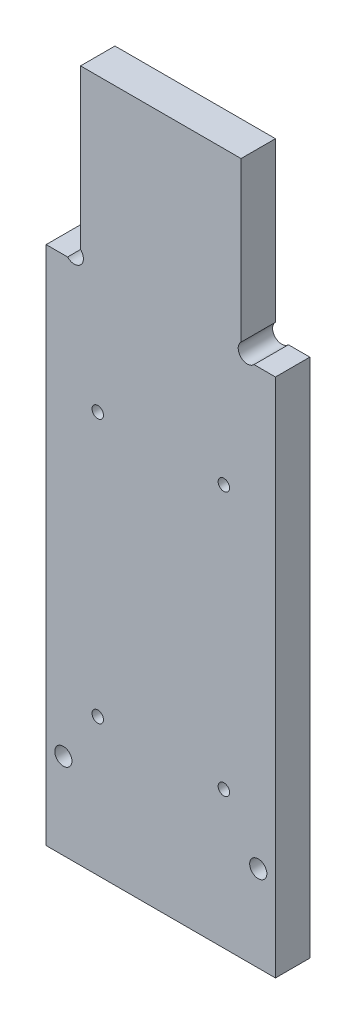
ISO-10303-21;
HEADER;
FILE_DESCRIPTION(('STEP AP214'),'2;1');
FILE_NAME('part.step','',(''),(''),'','','');
FILE_SCHEMA(('AUTOMOTIVE_DESIGN { 1 0 10303 214 1 1 1 1 }'));
ENDSEC;
DATA;
#1=APPLICATION_CONTEXT('core data for automotive mechanical design processes');
#2=APPLICATION_PROTOCOL_DEFINITION('international standard','automotive_design',2000,#1);
#3=PRODUCT_CONTEXT('',#1,'mechanical');
#4=PRODUCT('Part','Part','',(#3));
#5=PRODUCT_RELATED_PRODUCT_CATEGORY('part','',(#4));
#6=PRODUCT_DEFINITION_FORMATION('','',#4);
#7=PRODUCT_DEFINITION_CONTEXT('part definition',#1,'design');
#8=PRODUCT_DEFINITION('design','',#6,#7);
#9=PRODUCT_DEFINITION_SHAPE('','',#8);
#10=(LENGTH_UNIT() NAMED_UNIT(*) SI_UNIT(.MILLI.,.METRE.));
#11=(NAMED_UNIT(*) PLANE_ANGLE_UNIT() SI_UNIT($,.RADIAN.));
#12=(NAMED_UNIT(*) SI_UNIT($,.STERADIAN.) SOLID_ANGLE_UNIT());
#13=UNCERTAINTY_MEASURE_WITH_UNIT(LENGTH_MEASURE(1.E-05),#10,'distance_accuracy_value','');
#14=(GEOMETRIC_REPRESENTATION_CONTEXT(3) GLOBAL_UNCERTAINTY_ASSIGNED_CONTEXT((#13)) GLOBAL_UNIT_ASSIGNED_CONTEXT((#10,
#11,#12)) REPRESENTATION_CONTEXT('',''));
#15=CARTESIAN_POINT('',(0.,0.,0.));
#16=DIRECTION('',(0.,0.,1.));
#17=DIRECTION('',(1.,0.,0.));
#18=AXIS2_PLACEMENT_3D('',#15,#16,#17);
#19=CARTESIAN_POINT('',(-60.9183606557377,49.4675409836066,6.));
#20=DIRECTION('',(1.,0.,0.));
#21=DIRECTION('',(0.,1.,0.));
#22=AXIS2_PLACEMENT_3D('',#19,#20,#21);
#23=PLANE('',#22);
#24=DIRECTION('',(0.,-1.,0.));
#25=VECTOR('',#24,1.);
#26=CARTESIAN_POINT('',(-60.9183606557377,49.4675409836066,6.));
#27=LINE('',#26,#25);
#28=CARTESIAN_POINT('',(-60.9183606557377,19.4675409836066,6.));
#29=VERTEX_POINT('',#28);
#30=CARTESIAN_POINT('',(-60.9183606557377,-71.3324590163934,6.));
#31=VERTEX_POINT('',#30);
#32=EDGE_CURVE('E167',#29,#31,#27,.T.);
#33=ORIENTED_EDGE('',*,*,#32,.F.);
#34=DIRECTION('',(0.,0.,1.));
#35=VECTOR('',#34,1.);
#36=CARTESIAN_POINT('',(-60.9183606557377,19.4675409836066,0.));
#37=LINE('',#36,#35);
#38=CARTESIAN_POINT('',(-60.9183606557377,19.4675409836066,0.));
#39=VERTEX_POINT('',#38);
#40=EDGE_CURVE('E152',#39,#29,#37,.T.);
#41=ORIENTED_EDGE('',*,*,#40,.F.);
#42=DIRECTION('',(0.,-1.,0.));
#43=VECTOR('',#42,1.);
#44=CARTESIAN_POINT('',(-60.9183606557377,49.4675409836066,0.));
#45=LINE('',#44,#43);
#46=CARTESIAN_POINT('',(-60.9183606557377,-71.3324590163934,0.));
#47=VERTEX_POINT('',#46);
#48=EDGE_CURVE('E156',#39,#47,#45,.T.);
#49=ORIENTED_EDGE('',*,*,#48,.T.);
#50=DIRECTION('',(0.,0.,-1.));
#51=VECTOR('',#50,1.);
#52=CARTESIAN_POINT('',(-60.9183606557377,-71.3324590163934,6.));
#53=LINE('',#52,#51);
#54=EDGE_CURVE('E178',#31,#47,#53,.T.);
#55=ORIENTED_EDGE('',*,*,#54,.F.);
#56=EDGE_LOOP('',(#33,#41,#49,#55));
#57=FACE_BOUND('',#56,.T.);
#58=ADVANCED_FACE('F32',(#57),#23,.F.);
#59=CARTESIAN_POINT('',(-60.9183606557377,-71.3324590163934,6.));
#60=DIRECTION('',(0.,1.,0.));
#61=DIRECTION('',(0.,0.,1.));
#62=AXIS2_PLACEMENT_3D('',#59,#60,#61);
#63=PLANE('',#62);
#64=DIRECTION('',(1.,0.,0.));
#65=VECTOR('',#64,1.);
#66=CARTESIAN_POINT('',(-60.9183606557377,-71.3324590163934,0.));
#67=LINE('',#66,#65);
#68=CARTESIAN_POINT('',(-20.9183606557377,-71.3324590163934,0.));
#69=VERTEX_POINT('',#68);
#70=EDGE_CURVE('E159',#47,#69,#67,.T.);
#71=ORIENTED_EDGE('',*,*,#70,.T.);
#72=DIRECTION('',(0.,0.,-1.));
#73=VECTOR('',#72,1.);
#74=CARTESIAN_POINT('',(-20.9183606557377,-71.3324590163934,6.));
#75=LINE('',#74,#73);
#76=CARTESIAN_POINT('',(-20.9183606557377,-71.3324590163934,6.));
#77=VERTEX_POINT('',#76);
#78=EDGE_CURVE('E175',#77,#69,#75,.T.);
#79=ORIENTED_EDGE('',*,*,#78,.F.);
#80=DIRECTION('',(1.,0.,0.));
#81=VECTOR('',#80,1.);
#82=CARTESIAN_POINT('',(-60.9183606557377,-71.3324590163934,6.));
#83=LINE('',#82,#81);
#84=EDGE_CURVE('E169',#31,#77,#83,.T.);
#85=ORIENTED_EDGE('',*,*,#84,.F.);
#86=ORIENTED_EDGE('',*,*,#54,.T.);
#87=EDGE_LOOP('',(#71,#79,#85,#86));
#88=FACE_BOUND('',#87,.T.);
#89=ADVANCED_FACE('F233',(#88),#63,.F.);
#90=CARTESIAN_POINT('',(-20.9183606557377,49.4675409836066,6.));
#91=DIRECTION('',(-1.,0.,0.));
#92=DIRECTION('',(0.,-1.,0.));
#93=AXIS2_PLACEMENT_3D('',#90,#91,#92);
#94=PLANE('',#93);
#95=DIRECTION('',(0.,1.,0.));
#96=VECTOR('',#95,1.);
#97=CARTESIAN_POINT('',(-20.9183606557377,49.4675409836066,0.));
#98=LINE('',#97,#96);
#99=CARTESIAN_POINT('',(-20.9183606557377,19.4675409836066,0.));
#100=VERTEX_POINT('',#99);
#101=EDGE_CURVE('E161',#69,#100,#98,.T.);
#102=ORIENTED_EDGE('',*,*,#101,.T.);
#103=DIRECTION('',(0.,0.,1.));
#104=VECTOR('',#103,1.);
#105=CARTESIAN_POINT('',(-20.9183606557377,19.4675409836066,0.));
#106=LINE('',#105,#104);
#107=CARTESIAN_POINT('',(-20.9183606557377,19.4675409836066,6.));
#108=VERTEX_POINT('',#107);
#109=EDGE_CURVE('E138',#100,#108,#106,.T.);
#110=ORIENTED_EDGE('',*,*,#109,.T.);
#111=DIRECTION('',(0.,1.,0.));
#112=VECTOR('',#111,1.);
#113=CARTESIAN_POINT('',(-20.9183606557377,49.4675409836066,6.));
#114=LINE('',#113,#112);
#115=EDGE_CURVE('E171',#77,#108,#114,.T.);
#116=ORIENTED_EDGE('',*,*,#115,.F.);
#117=ORIENTED_EDGE('',*,*,#78,.T.);
#118=EDGE_LOOP('',(#102,#110,#116,#117));
#119=FACE_BOUND('',#118,.T.);
#120=ADVANCED_FACE('F227',(#119),#94,.F.);
#121=CARTESIAN_POINT('',(-60.9183606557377,49.4675409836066,6.));
#122=DIRECTION('',(0.,-1.,0.));
#123=DIRECTION('',(0.,0.,-1.));
#124=AXIS2_PLACEMENT_3D('',#121,#122,#123);
#125=PLANE('',#124);
#126=DIRECTION('',(-1.,0.,0.));
#127=VECTOR('',#126,1.);
#128=CARTESIAN_POINT('',(-60.9183606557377,49.4675409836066,6.));
#129=LINE('',#128,#127);
#130=CARTESIAN_POINT('',(-26.9183606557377,49.4675409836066,6.));
#131=VERTEX_POINT('',#130);
#132=CARTESIAN_POINT('',(-54.9183606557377,49.4675409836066,6.));
#133=VERTEX_POINT('',#132);
#134=EDGE_CURVE('E173',#131,#133,#129,.T.);
#135=ORIENTED_EDGE('',*,*,#134,.F.);
#136=DIRECTION('',(0.,0.,1.));
#137=VECTOR('',#136,1.);
#138=CARTESIAN_POINT('',(-26.9183606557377,49.4675409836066,0.));
#139=LINE('',#138,#137);
#140=CARTESIAN_POINT('',(-26.9183606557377,49.4675409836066,0.));
#141=VERTEX_POINT('',#140);
#142=EDGE_CURVE('E125',#141,#131,#139,.T.);
#143=ORIENTED_EDGE('',*,*,#142,.F.);
#144=DIRECTION('',(-1.,0.,0.));
#145=VECTOR('',#144,1.);
#146=CARTESIAN_POINT('',(-60.9183606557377,49.4675409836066,0.));
#147=LINE('',#146,#145);
#148=CARTESIAN_POINT('',(-54.9183606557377,49.4675409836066,0.));
#149=VERTEX_POINT('',#148);
#150=EDGE_CURVE('E164',#141,#149,#147,.T.);
#151=ORIENTED_EDGE('',*,*,#150,.T.);
#152=DIRECTION('',(0.,0.,1.));
#153=VECTOR('',#152,1.);
#154=CARTESIAN_POINT('',(-54.9183606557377,49.4675409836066,0.));
#155=LINE('',#154,#153);
#156=EDGE_CURVE('E153',#149,#133,#155,.T.);
#157=ORIENTED_EDGE('',*,*,#156,.T.);
#158=EDGE_LOOP('',(#135,#143,#151,#157));
#159=FACE_BOUND('',#158,.T.);
#160=ADVANCED_FACE('F217',(#159),#125,.F.);
#161=CARTESIAN_POINT('',(-60.9183606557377,-71.3324590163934,6.));
#162=DIRECTION('',(0.,0.,1.));
#163=DIRECTION('',(1.,0.,0.));
#164=AXIS2_PLACEMENT_3D('',#161,#162,#163);
#165=PLANE('',#164);
#166=CARTESIAN_POINT('',(-29.9183606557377,-47.3324590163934,6.));
#167=DIRECTION('',(0.,0.,1.));
#168=DIRECTION('',(1.,0.,0.));
#169=AXIS2_PLACEMENT_3D('',#166,#167,#168);
#170=CIRCLE('',#169,1.);
#171=CARTESIAN_POINT('',(-28.9183606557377,-47.3324590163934,6.));
#172=VERTEX_POINT('',#171);
#173=EDGE_CURVE('E314',#172,#172,#170,.T.);
#174=ORIENTED_EDGE('',*,*,#173,.F.);
#175=EDGE_LOOP('',(#174));
#176=FACE_BOUND('',#175,.T.);
#177=CARTESIAN_POINT('',(-51.9183606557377,-47.3324590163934,6.));
#178=DIRECTION('',(0.,0.,1.));
#179=DIRECTION('',(1.,0.,0.));
#180=AXIS2_PLACEMENT_3D('',#177,#178,#179);
#181=CIRCLE('',#180,0.999999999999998);
#182=CARTESIAN_POINT('',(-50.9183606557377,-47.3324590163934,6.));
#183=VERTEX_POINT('',#182);
#184=EDGE_CURVE('E313',#183,#183,#181,.T.);
#185=ORIENTED_EDGE('',*,*,#184,.F.);
#186=EDGE_LOOP('',(#185));
#187=FACE_BOUND('',#186,.T.);
#188=CARTESIAN_POINT('',(-29.9183606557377,-1.33245901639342,6.));
#189=DIRECTION('',(0.,0.,1.));
#190=DIRECTION('',(1.,0.,0.));
#191=AXIS2_PLACEMENT_3D('',#188,#189,#190);
#192=CIRCLE('',#191,1.);
#193=CARTESIAN_POINT('',(-28.9183606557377,-1.33245901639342,6.));
#194=VERTEX_POINT('',#193);
#195=EDGE_CURVE('E324',#194,#194,#192,.T.);
#196=ORIENTED_EDGE('',*,*,#195,.F.);
#197=EDGE_LOOP('',(#196));
#198=FACE_BOUND('',#197,.T.);
#199=CARTESIAN_POINT('',(-51.9183606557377,-1.33245901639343,6.));
#200=DIRECTION('',(0.,0.,1.));
#201=DIRECTION('',(1.,0.,0.));
#202=AXIS2_PLACEMENT_3D('',#199,#200,#201);
#203=CIRCLE('',#202,0.999999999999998);
#204=CARTESIAN_POINT('',(-50.9183606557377,-1.33245901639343,6.));
#205=VERTEX_POINT('',#204);
#206=EDGE_CURVE('E330',#205,#205,#203,.T.);
#207=ORIENTED_EDGE('',*,*,#206,.F.);
#208=EDGE_LOOP('',(#207));
#209=FACE_BOUND('',#208,.T.);
#210=CARTESIAN_POINT('',(-25.8183606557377,20.5675409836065,6.));
#211=DIRECTION('',(0.,0.,1.));
#212=DIRECTION('',(1.,0.,0.));
#213=AXIS2_PLACEMENT_3D('',#210,#211,#212);
#214=CIRCLE('',#213,1.6);
#215=CARTESIAN_POINT('',(-26.9183606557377,21.7294359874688,6.));
#216=VERTEX_POINT('',#215);
#217=CARTESIAN_POINT('',(-24.6564656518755,19.4675409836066,6.));
#218=VERTEX_POINT('',#217);
#219=EDGE_CURVE('E106',#216,#218,#214,.T.);
#220=ORIENTED_EDGE('',*,*,#219,.F.);
#221=DIRECTION('',(0.,-1.,0.));
#222=VECTOR('',#221,1.);
#223=CARTESIAN_POINT('',(-26.9183606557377,49.4675409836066,6.));
#224=LINE('',#223,#222);
#225=EDGE_CURVE('E117',#131,#216,#224,.T.);
#226=ORIENTED_EDGE('',*,*,#225,.F.);
#227=ORIENTED_EDGE('',*,*,#134,.T.);
#228=DIRECTION('',(0.,1.,0.));
#229=VECTOR('',#228,1.);
#230=CARTESIAN_POINT('',(-54.9183606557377,49.4675409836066,6.));
#231=LINE('',#230,#229);
#232=CARTESIAN_POINT('',(-54.9183606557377,21.7294359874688,6.));
#233=VERTEX_POINT('',#232);
#234=EDGE_CURVE('E145',#233,#133,#231,.T.);
#235=ORIENTED_EDGE('',*,*,#234,.F.);
#236=CARTESIAN_POINT('',(-56.0183606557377,20.5675409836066,6.));
#237=DIRECTION('',(0.,0.,1.));
#238=DIRECTION('',(1.,0.,0.));
#239=AXIS2_PLACEMENT_3D('',#236,#237,#238);
#240=CIRCLE('',#239,1.6);
#241=CARTESIAN_POINT('',(-57.1802556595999,19.4675409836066,6.));
#242=VERTEX_POINT('',#241);
#243=EDGE_CURVE('E196',#242,#233,#240,.T.);
#244=ORIENTED_EDGE('',*,*,#243,.F.);
#245=DIRECTION('',(1.,0.,0.));
#246=VECTOR('',#245,1.);
#247=CARTESIAN_POINT('',(-60.9183606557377,19.4675409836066,6.));
#248=LINE('',#247,#246);
#249=EDGE_CURVE('E141',#29,#242,#248,.T.);
#250=ORIENTED_EDGE('',*,*,#249,.F.);
#251=ORIENTED_EDGE('',*,*,#32,.T.);
#252=ORIENTED_EDGE('',*,*,#84,.T.);
#253=ORIENTED_EDGE('',*,*,#115,.T.);
#254=DIRECTION('',(1.,0.,0.));
#255=VECTOR('',#254,1.);
#256=CARTESIAN_POINT('',(-20.9183606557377,19.4675409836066,6.));
#257=LINE('',#256,#255);
#258=EDGE_CURVE('E120',#218,#108,#257,.T.);
#259=ORIENTED_EDGE('',*,*,#258,.F.);
#260=EDGE_LOOP('',(#220,#226,#227,#235,#244,#250,#251,#252,#253,#259));
#261=FACE_BOUND('',#260,.T.);
#262=CARTESIAN_POINT('',(-57.9183606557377,-56.3324590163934,6.));
#263=DIRECTION('',(0.,0.,1.));
#264=DIRECTION('',(1.,0.,0.));
#265=AXIS2_PLACEMENT_3D('',#262,#263,#264);
#266=CIRCLE('',#265,1.5);
#267=CARTESIAN_POINT('',(-56.4183606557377,-56.3324590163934,6.));
#268=VERTEX_POINT('',#267);
#269=EDGE_CURVE('E206',#268,#268,#266,.T.);
#270=ORIENTED_EDGE('',*,*,#269,.F.);
#271=EDGE_LOOP('',(#270));
#272=FACE_BOUND('',#271,.T.);
#273=CARTESIAN_POINT('',(-23.9183606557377,-56.3324590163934,6.));
#274=DIRECTION('',(0.,0.,1.));
#275=DIRECTION('',(1.,0.,0.));
#276=AXIS2_PLACEMENT_3D('',#273,#274,#275);
#277=CIRCLE('',#276,1.5);
#278=CARTESIAN_POINT('',(-22.4183606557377,-56.3324590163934,6.));
#279=VERTEX_POINT('',#278);
#280=EDGE_CURVE('E131',#279,#279,#277,.T.);
#281=ORIENTED_EDGE('',*,*,#280,.F.);
#282=EDGE_LOOP('',(#281));
#283=FACE_BOUND('',#282,.T.);
#284=ADVANCED_FACE('F114',(#176,#187,#198,#209,#261,#272,#283),#165,.T.);
#285=CARTESIAN_POINT('',(-60.9183606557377,-71.3324590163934,0.));
#286=DIRECTION('',(0.,0.,1.));
#287=DIRECTION('',(1.,0.,0.));
#288=AXIS2_PLACEMENT_3D('',#285,#286,#287);
#289=PLANE('',#288);
#290=CARTESIAN_POINT('',(-57.9183606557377,-56.3324590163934,0.));
#291=DIRECTION('',(0.,0.,1.));
#292=DIRECTION('',(1.,0.,0.));
#293=AXIS2_PLACEMENT_3D('',#290,#291,#292);
#294=CIRCLE('',#293,1.5);
#295=CARTESIAN_POINT('',(-56.4183606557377,-56.3324590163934,0.));
#296=VERTEX_POINT('',#295);
#297=EDGE_CURVE('E209',#296,#296,#294,.T.);
#298=ORIENTED_EDGE('',*,*,#297,.T.);
#299=EDGE_LOOP('',(#298));
#300=FACE_BOUND('',#299,.T.);
#301=CARTESIAN_POINT('',(-23.9183606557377,-56.3324590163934,0.));
#302=DIRECTION('',(0.,0.,1.));
#303=DIRECTION('',(1.,0.,0.));
#304=AXIS2_PLACEMENT_3D('',#301,#302,#303);
#305=CIRCLE('',#304,1.5);
#306=CARTESIAN_POINT('',(-22.4183606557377,-56.3324590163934,0.));
#307=VERTEX_POINT('',#306);
#308=EDGE_CURVE('E126',#307,#307,#305,.T.);
#309=ORIENTED_EDGE('',*,*,#308,.T.);
#310=EDGE_LOOP('',(#309));
#311=FACE_BOUND('',#310,.T.);
#312=DIRECTION('',(0.,-1.,0.));
#313=VECTOR('',#312,1.);
#314=CARTESIAN_POINT('',(-26.9183606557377,49.4675409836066,0.));
#315=LINE('',#314,#313);
#316=CARTESIAN_POINT('',(-26.9183606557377,21.7294359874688,0.));
#317=VERTEX_POINT('',#316);
#318=EDGE_CURVE('E128',#141,#317,#315,.T.);
#319=ORIENTED_EDGE('',*,*,#318,.T.);
#320=CARTESIAN_POINT('',(-25.8183606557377,20.5675409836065,0.));
#321=DIRECTION('',(0.,0.,1.));
#322=DIRECTION('',(1.,0.,0.));
#323=AXIS2_PLACEMENT_3D('',#320,#321,#322);
#324=CIRCLE('',#323,1.6);
#325=CARTESIAN_POINT('',(-24.6564656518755,19.4675409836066,0.));
#326=VERTEX_POINT('',#325);
#327=EDGE_CURVE('E46',#317,#326,#324,.T.);
#328=ORIENTED_EDGE('',*,*,#327,.T.);
#329=DIRECTION('',(1.,0.,0.));
#330=VECTOR('',#329,1.);
#331=CARTESIAN_POINT('',(-20.9183606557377,19.4675409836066,0.));
#332=LINE('',#331,#330);
#333=EDGE_CURVE('E136',#326,#100,#332,.T.);
#334=ORIENTED_EDGE('',*,*,#333,.T.);
#335=ORIENTED_EDGE('',*,*,#101,.F.);
#336=ORIENTED_EDGE('',*,*,#70,.F.);
#337=ORIENTED_EDGE('',*,*,#48,.F.);
#338=DIRECTION('',(1.,0.,0.));
#339=VECTOR('',#338,1.);
#340=CARTESIAN_POINT('',(-60.9183606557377,19.4675409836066,0.));
#341=LINE('',#340,#339);
#342=CARTESIAN_POINT('',(-57.1802556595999,19.4675409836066,0.));
#343=VERTEX_POINT('',#342);
#344=EDGE_CURVE('E147',#39,#343,#341,.T.);
#345=ORIENTED_EDGE('',*,*,#344,.T.);
#346=CARTESIAN_POINT('',(-56.0183606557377,20.5675409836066,0.));
#347=DIRECTION('',(0.,0.,1.));
#348=DIRECTION('',(1.,0.,0.));
#349=AXIS2_PLACEMENT_3D('',#346,#347,#348);
#350=CIRCLE('',#349,1.6);
#351=CARTESIAN_POINT('',(-54.9183606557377,21.7294359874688,0.));
#352=VERTEX_POINT('',#351);
#353=EDGE_CURVE('E53',#343,#352,#350,.T.);
#354=ORIENTED_EDGE('',*,*,#353,.T.);
#355=DIRECTION('',(0.,1.,0.));
#356=VECTOR('',#355,1.);
#357=CARTESIAN_POINT('',(-54.9183606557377,49.4675409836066,0.));
#358=LINE('',#357,#356);
#359=EDGE_CURVE('E150',#352,#149,#358,.T.);
#360=ORIENTED_EDGE('',*,*,#359,.T.);
#361=ORIENTED_EDGE('',*,*,#150,.F.);
#362=EDGE_LOOP('',(#319,#328,#334,#335,#336,#337,#345,#354,#360,#361));
#363=FACE_BOUND('',#362,.T.);
#364=ADVANCED_FACE('F187',(#300,#311,#363),#289,.F.);
#365=CARTESIAN_POINT('',(-54.9183606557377,49.4675409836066,0.));
#366=DIRECTION('',(1.,0.,0.));
#367=DIRECTION('',(0.,1.,0.));
#368=AXIS2_PLACEMENT_3D('',#365,#366,#367);
#369=PLANE('',#368);
#370=ORIENTED_EDGE('',*,*,#359,.F.);
#371=DIRECTION('',(0.,0.,1.));
#372=VECTOR('',#371,1.);
#373=CARTESIAN_POINT('',(-54.9183606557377,21.7294359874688,0.));
#374=LINE('',#373,#372);
#375=EDGE_CURVE('E200',#352,#233,#374,.T.);
#376=ORIENTED_EDGE('',*,*,#375,.T.);
#377=ORIENTED_EDGE('',*,*,#234,.T.);
#378=ORIENTED_EDGE('',*,*,#156,.F.);
#379=EDGE_LOOP('',(#370,#376,#377,#378));
#380=FACE_BOUND('',#379,.T.);
#381=ADVANCED_FACE('F224',(#380),#369,.F.);
#382=CARTESIAN_POINT('',(-60.9183606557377,19.4675409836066,0.));
#383=DIRECTION('',(0.,-1.,0.));
#384=DIRECTION('',(0.,0.,-1.));
#385=AXIS2_PLACEMENT_3D('',#382,#383,#384);
#386=PLANE('',#385);
#387=ORIENTED_EDGE('',*,*,#249,.T.);
#388=DIRECTION('',(0.,0.,1.));
#389=VECTOR('',#388,1.);
#390=CARTESIAN_POINT('',(-57.1802556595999,19.4675409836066,0.));
#391=LINE('',#390,#389);
#392=EDGE_CURVE('E39',#242,#343,#391,.F.);
#393=ORIENTED_EDGE('',*,*,#392,.T.);
#394=ORIENTED_EDGE('',*,*,#344,.F.);
#395=ORIENTED_EDGE('',*,*,#40,.T.);
#396=EDGE_LOOP('',(#387,#393,#394,#395));
#397=FACE_BOUND('',#396,.T.);
#398=ADVANCED_FACE('F181',(#397),#386,.F.);
#399=CARTESIAN_POINT('',(-20.9183606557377,19.4675409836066,0.));
#400=DIRECTION('',(0.,-1.,0.));
#401=DIRECTION('',(1.,0.,0.));
#402=AXIS2_PLACEMENT_3D('',#399,#400,#401);
#403=PLANE('',#402);
#404=ORIENTED_EDGE('',*,*,#333,.F.);
#405=DIRECTION('',(0.,0.,1.));
#406=VECTOR('',#405,1.);
#407=CARTESIAN_POINT('',(-24.6564656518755,19.4675409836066,0.));
#408=LINE('',#407,#406);
#409=EDGE_CURVE('E198',#326,#218,#408,.T.);
#410=ORIENTED_EDGE('',*,*,#409,.T.);
#411=ORIENTED_EDGE('',*,*,#258,.T.);
#412=ORIENTED_EDGE('',*,*,#109,.F.);
#413=EDGE_LOOP('',(#404,#410,#411,#412));
#414=FACE_BOUND('',#413,.T.);
#415=ADVANCED_FACE('F248',(#414),#403,.F.);
#416=CARTESIAN_POINT('',(-26.9183606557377,49.4675409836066,0.));
#417=DIRECTION('',(-1.,0.,0.));
#418=DIRECTION('',(0.,0.,1.));
#419=AXIS2_PLACEMENT_3D('',#416,#417,#418);
#420=PLANE('',#419);
#421=ORIENTED_EDGE('',*,*,#225,.T.);
#422=DIRECTION('',(0.,0.,1.));
#423=VECTOR('',#422,1.);
#424=CARTESIAN_POINT('',(-26.9183606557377,21.7294359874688,0.));
#425=LINE('',#424,#423);
#426=EDGE_CURVE('E11',#216,#317,#425,.F.);
#427=ORIENTED_EDGE('',*,*,#426,.T.);
#428=ORIENTED_EDGE('',*,*,#318,.F.);
#429=ORIENTED_EDGE('',*,*,#142,.T.);
#430=EDGE_LOOP('',(#421,#427,#428,#429));
#431=FACE_BOUND('',#430,.T.);
#432=ADVANCED_FACE('F123',(#431),#420,.F.);
#433=CARTESIAN_POINT('',(-23.9183606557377,-56.3324590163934,0.));
#434=DIRECTION('',(0.,0.,1.));
#435=DIRECTION('',(1.,0.,0.));
#436=AXIS2_PLACEMENT_3D('',#433,#434,#435);
#437=CYLINDRICAL_SURFACE('',#436,1.5);
#438=ORIENTED_EDGE('',*,*,#308,.F.);
#439=EDGE_LOOP('',(#438));
#440=FACE_BOUND('',#439,.T.);
#441=ORIENTED_EDGE('',*,*,#280,.T.);
#442=EDGE_LOOP('',(#441));
#443=FACE_BOUND('',#442,.T.);
#444=ADVANCED_FACE('F214',(#440,#443),#437,.F.);
#445=CARTESIAN_POINT('',(-57.9183606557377,-56.3324590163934,0.));
#446=DIRECTION('',(0.,0.,1.));
#447=DIRECTION('',(1.,0.,0.));
#448=AXIS2_PLACEMENT_3D('',#445,#446,#447);
#449=CYLINDRICAL_SURFACE('',#448,1.5);
#450=ORIENTED_EDGE('',*,*,#297,.F.);
#451=EDGE_LOOP('',(#450));
#452=FACE_BOUND('',#451,.T.);
#453=ORIENTED_EDGE('',*,*,#269,.T.);
#454=EDGE_LOOP('',(#453));
#455=FACE_BOUND('',#454,.T.);
#456=ADVANCED_FACE('F268',(#452,#455),#449,.F.);
#457=CARTESIAN_POINT('',(-56.0183606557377,20.5675409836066,0.));
#458=DIRECTION('',(0.,0.,1.));
#459=DIRECTION('',(1.,0.,0.));
#460=AXIS2_PLACEMENT_3D('',#457,#458,#459);
#461=CYLINDRICAL_SURFACE('',#460,1.6);
#462=ORIENTED_EDGE('',*,*,#353,.F.);
#463=ORIENTED_EDGE('',*,*,#392,.F.);
#464=ORIENTED_EDGE('',*,*,#243,.T.);
#465=ORIENTED_EDGE('',*,*,#375,.F.);
#466=EDGE_LOOP('',(#462,#463,#464,#465));
#467=FACE_BOUND('',#466,.T.);
#468=ADVANCED_FACE('F266',(#467),#461,.F.);
#469=CARTESIAN_POINT('',(-25.8183606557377,20.5675409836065,0.));
#470=DIRECTION('',(0.,0.,1.));
#471=DIRECTION('',(1.,0.,0.));
#472=AXIS2_PLACEMENT_3D('',#469,#470,#471);
#473=CYLINDRICAL_SURFACE('',#472,1.6);
#474=ORIENTED_EDGE('',*,*,#327,.F.);
#475=ORIENTED_EDGE('',*,*,#426,.F.);
#476=ORIENTED_EDGE('',*,*,#219,.T.);
#477=ORIENTED_EDGE('',*,*,#409,.F.);
#478=EDGE_LOOP('',(#474,#475,#476,#477));
#479=FACE_BOUND('',#478,.T.);
#480=ADVANCED_FACE('F105',(#479),#473,.F.);
#481=CARTESIAN_POINT('',(-51.9183606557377,-1.33245901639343,1.));
#482=DIRECTION('',(0.,0.,1.));
#483=DIRECTION('',(1.,0.,0.));
#484=AXIS2_PLACEMENT_3D('',#481,#482,#483);
#485=CYLINDRICAL_SURFACE('',#484,0.999999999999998);
#486=CARTESIAN_POINT('',(-51.9183606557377,-1.33245901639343,1.));
#487=DIRECTION('',(0.,0.,1.));
#488=DIRECTION('',(1.,0.,0.));
#489=AXIS2_PLACEMENT_3D('',#486,#487,#488);
#490=CIRCLE('',#489,0.999999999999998);
#491=CARTESIAN_POINT('',(-50.9183606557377,-1.33245901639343,1.));
#492=VERTEX_POINT('',#491);
#493=EDGE_CURVE('E121',#492,#492,#490,.T.);
#494=ORIENTED_EDGE('',*,*,#493,.F.);
#495=EDGE_LOOP('',(#494));
#496=FACE_BOUND('',#495,.T.);
#497=ORIENTED_EDGE('',*,*,#206,.T.);
#498=EDGE_LOOP('',(#497));
#499=FACE_BOUND('',#498,.T.);
#500=ADVANCED_FACE('F274',(#496,#499),#485,.F.);
#501=CARTESIAN_POINT('',(-51.9183606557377,-1.33245901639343,1.));
#502=DIRECTION('',(0.,0.,1.));
#503=DIRECTION('',(1.,0.,0.));
#504=AXIS2_PLACEMENT_3D('',#501,#502,#503);
#505=PLANE('',#504);
#506=ORIENTED_EDGE('',*,*,#493,.T.);
#507=EDGE_LOOP('',(#506));
#508=FACE_BOUND('',#507,.T.);
#509=ADVANCED_FACE('F280',(#508),#505,.T.);
#510=CARTESIAN_POINT('',(-29.9183606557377,-1.33245901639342,1.));
#511=DIRECTION('',(0.,0.,1.));
#512=DIRECTION('',(1.,0.,0.));
#513=AXIS2_PLACEMENT_3D('',#510,#511,#512);
#514=CYLINDRICAL_SURFACE('',#513,1.);
#515=CARTESIAN_POINT('',(-29.9183606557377,-1.33245901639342,1.));
#516=DIRECTION('',(0.,0.,1.));
#517=DIRECTION('',(1.,0.,0.));
#518=AXIS2_PLACEMENT_3D('',#515,#516,#517);
#519=CIRCLE('',#518,1.);
#520=CARTESIAN_POINT('',(-28.9183606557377,-1.33245901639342,1.));
#521=VERTEX_POINT('',#520);
#522=EDGE_CURVE('E327',#521,#521,#519,.T.);
#523=ORIENTED_EDGE('',*,*,#522,.F.);
#524=EDGE_LOOP('',(#523));
#525=FACE_BOUND('',#524,.T.);
#526=ORIENTED_EDGE('',*,*,#195,.T.);
#527=EDGE_LOOP('',(#526));
#528=FACE_BOUND('',#527,.T.);
#529=ADVANCED_FACE('F284',(#525,#528),#514,.F.);
#530=CARTESIAN_POINT('',(-29.9183606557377,-1.33245901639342,1.));
#531=DIRECTION('',(0.,0.,1.));
#532=DIRECTION('',(1.,0.,0.));
#533=AXIS2_PLACEMENT_3D('',#530,#531,#532);
#534=PLANE('',#533);
#535=ORIENTED_EDGE('',*,*,#522,.T.);
#536=EDGE_LOOP('',(#535));
#537=FACE_BOUND('',#536,.T.);
#538=ADVANCED_FACE('F288',(#537),#534,.T.);
#539=CARTESIAN_POINT('',(-51.9183606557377,-47.3324590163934,1.));
#540=DIRECTION('',(0.,0.,1.));
#541=DIRECTION('',(1.,0.,0.));
#542=AXIS2_PLACEMENT_3D('',#539,#540,#541);
#543=CYLINDRICAL_SURFACE('',#542,0.999999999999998);
#544=CARTESIAN_POINT('',(-51.9183606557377,-47.3324590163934,1.));
#545=DIRECTION('',(0.,0.,1.));
#546=DIRECTION('',(1.,0.,0.));
#547=AXIS2_PLACEMENT_3D('',#544,#545,#546);
#548=CIRCLE('',#547,0.999999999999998);
#549=CARTESIAN_POINT('',(-50.9183606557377,-47.3324590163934,1.));
#550=VERTEX_POINT('',#549);
#551=EDGE_CURVE('E317',#550,#550,#548,.T.);
#552=ORIENTED_EDGE('',*,*,#551,.F.);
#553=EDGE_LOOP('',(#552));
#554=FACE_BOUND('',#553,.T.);
#555=ORIENTED_EDGE('',*,*,#184,.T.);
#556=EDGE_LOOP('',(#555));
#557=FACE_BOUND('',#556,.T.);
#558=ADVANCED_FACE('F292',(#554,#557),#543,.F.);
#559=CARTESIAN_POINT('',(-51.9183606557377,-47.3324590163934,1.));
#560=DIRECTION('',(0.,0.,1.));
#561=DIRECTION('',(1.,0.,0.));
#562=AXIS2_PLACEMENT_3D('',#559,#560,#561);
#563=PLANE('',#562);
#564=ORIENTED_EDGE('',*,*,#551,.T.);
#565=EDGE_LOOP('',(#564));
#566=FACE_BOUND('',#565,.T.);
#567=ADVANCED_FACE('F296',(#566),#563,.T.);
#568=CARTESIAN_POINT('',(-29.9183606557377,-47.3324590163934,1.));
#569=DIRECTION('',(0.,0.,1.));
#570=DIRECTION('',(1.,0.,0.));
#571=AXIS2_PLACEMENT_3D('',#568,#569,#570);
#572=CYLINDRICAL_SURFACE('',#571,1.);
#573=CARTESIAN_POINT('',(-29.9183606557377,-47.3324590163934,1.));
#574=DIRECTION('',(0.,0.,1.));
#575=DIRECTION('',(1.,0.,0.));
#576=AXIS2_PLACEMENT_3D('',#573,#574,#575);
#577=CIRCLE('',#576,1.);
#578=CARTESIAN_POINT('',(-28.9183606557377,-47.3324590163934,1.));
#579=VERTEX_POINT('',#578);
#580=EDGE_CURVE('E312',#579,#579,#577,.T.);
#581=ORIENTED_EDGE('',*,*,#580,.F.);
#582=EDGE_LOOP('',(#581));
#583=FACE_BOUND('',#582,.T.);
#584=ORIENTED_EDGE('',*,*,#173,.T.);
#585=EDGE_LOOP('',(#584));
#586=FACE_BOUND('',#585,.T.);
#587=ADVANCED_FACE('F300',(#583,#586),#572,.F.);
#588=CARTESIAN_POINT('',(-29.9183606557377,-47.3324590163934,1.));
#589=DIRECTION('',(0.,0.,1.));
#590=DIRECTION('',(1.,0.,0.));
#591=AXIS2_PLACEMENT_3D('',#588,#589,#590);
#592=PLANE('',#591);
#593=ORIENTED_EDGE('',*,*,#580,.T.);
#594=EDGE_LOOP('',(#593));
#595=FACE_BOUND('',#594,.T.);
#596=ADVANCED_FACE('F304',(#595),#592,.T.);
#597=CLOSED_SHELL('',(#58,#89,#120,#160,#284,#364,#381,#398,#415,#432,#444,#456,#468,#480,#500,
#509,#529,#538,#558,#567,#587,#596));
#598=MANIFOLD_SOLID_BREP('B2',#597);
#599=ADVANCED_BREP_SHAPE_REPRESENTATION('',(#18,#598),#14);
#600=SHAPE_DEFINITION_REPRESENTATION(#9,#599);
ENDSEC;
END-ISO-10303-21;
